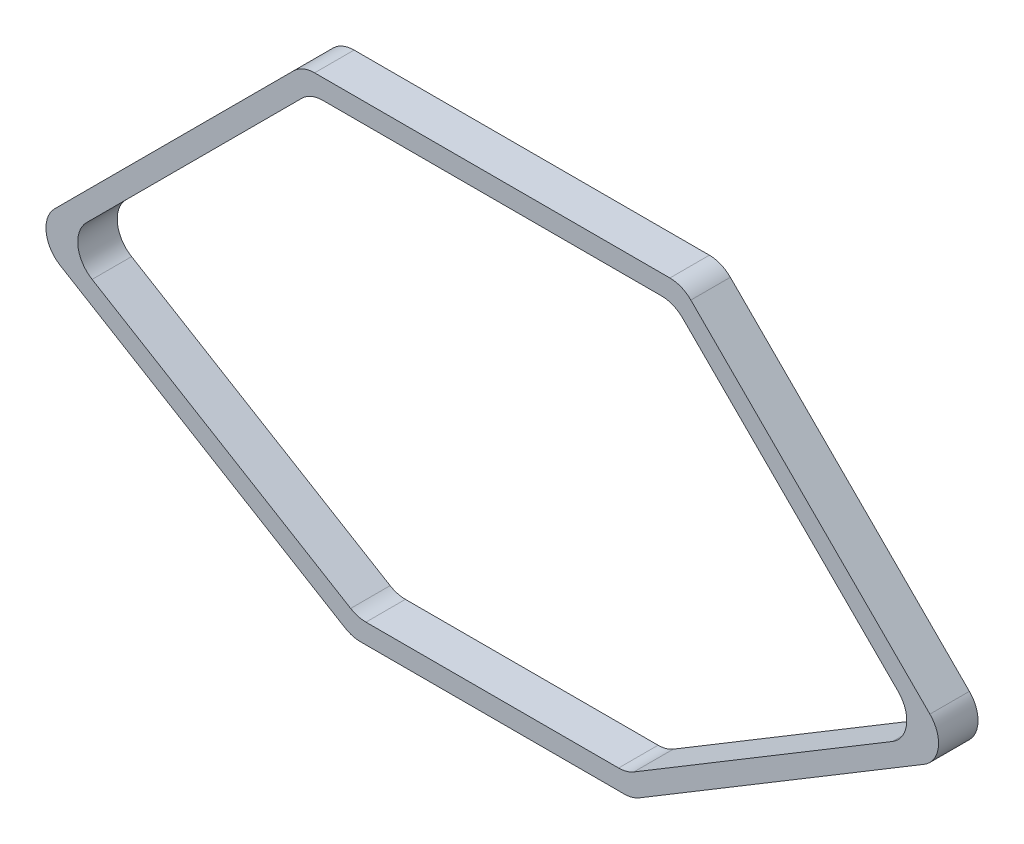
from build123d import *

# Parameters (mm, degrees)
COILCROSSSECTION_W = 3.175
COILCROSSSECTION_H = 1.5875
FILLET1_R          = 2.38125


with BuildPart() as part:
    # Sweep1: sweep along a path in CoilPath
    with BuildLine(Plane.XY) as sweep1_path:
        Line((-36.072456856, -0.626078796), (-14.94506403, 20.50131403))
        Line((-14.94506403, 20.50131403), (14.94506403, 20.50131403))
        Line((14.94506403, 20.50131403), (36.072456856, -0.626078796))
        Line((36.072456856, -0.626078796), (11.041896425, -15.69368597))
        Line((11.041896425, -15.69368597), (-11.041896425, -15.69368597))
        Line((-11.041896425, -15.69368597), (-36.072456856, -0.626078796))
    # CoilCrossSection → Sweep1 (sweep)
    with BuildSketch(Plane(origin=(0, 0, 0), x_dir=(0, 0, -1), z_dir=(1, 0, 0))):
        with Locations((0, 20.50131403)):
            Rectangle(COILCROSSSECTION_W, COILCROSSSECTION_H)
    sweep(path=sweep1_path.line, transition=Transition.RIGHT)

    # Fillet1
    fillet1_edges = [part.edges().sort_by_distance(p)[0] for p in [
        (-37.35150857, -0.782598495, 0),
        (-15.273846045, 21.29506403, 0),
        (15.273846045, 21.29506403, 0),
        (-11.262370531, -16.48743597, 0),
        (11.262370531, -16.48743597, 0),
        (37.35150857, -0.782598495, 0),
        (-34.793405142, -0.469559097, 0),
        (-10.821422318, -14.89993597, 0),
        (10.821422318, -14.89993597, 0),
        (34.793405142, -0.469559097, 0),
        (14.616282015, 19.70756403, 0),
        (-14.616282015, 19.70756403, 0),
    ]]
    fillet(fillet1_edges, radius=FILLET1_R)


solid = part.part
